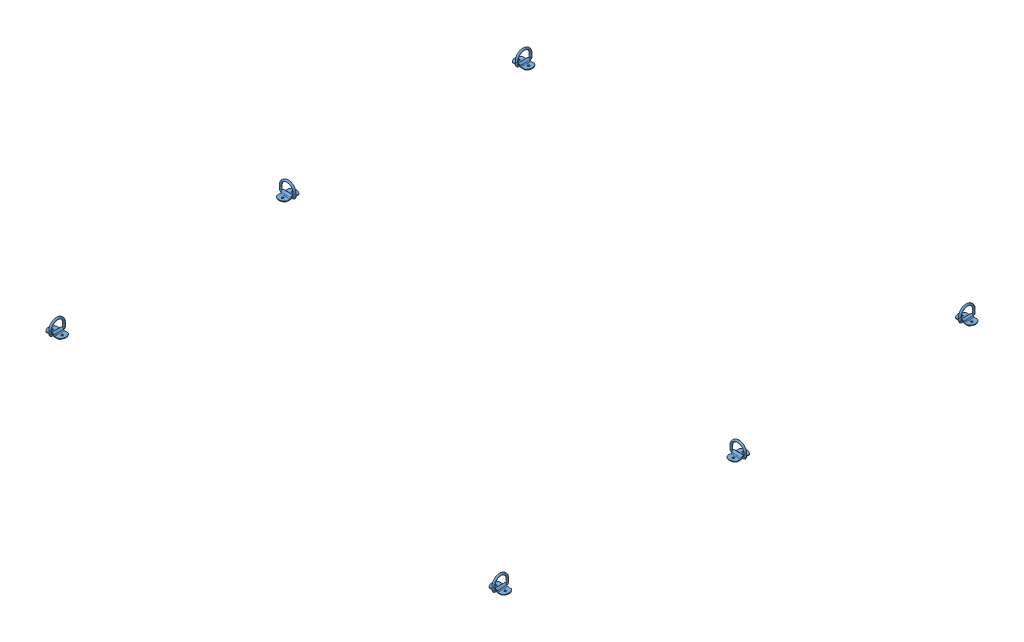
SolidWorks assembly sheet assem v2.SLDASM, configuration Default (file format 10000). Lengths in mm.
Overall size (1574.8 61.98 2235.2).
8 component instances, 3 part files, 21 mates.
Components (placement in the parent):
- Part H-1: Part H.SLDPRT [Default] at (1163.067 801.1916 852.2516) size (1574.8 19.05 1219.2)
- Part I-2: Part I.SLDPRT [cut] at (1163.067 801.1916 2071.4516) size (1574.8 19.05 1016)
- 3076T340_TIE-DOWN RING-19: 3076T340_TIE-DOWN RING.SLDPRT [Default] at (22.4482 823.4801 718.9016) x (0 0 1) z (-1 0 0) size (50.8 42.93 55.56)
- 3076T340_TIE-DOWN RING-20: 3076T340_TIE-DOWN RING.SLDPRT [Default] at (1440.0857 823.4801 718.9016) x (0 0 1) z (-1 0 0) size (50.8 42.93 55.56)
- 3076T340_TIE-DOWN RING-21: 3076T340_TIE-DOWN RING.SLDPRT [Default] at (10.542 823.4801 1461.917) size (50.8 42.93 55.56)
- 3076T340_TIE-DOWN RING-22: 3076T340_TIE-DOWN RING.SLDPRT [Default] at (1451.992 823.4801 1461.917) size (50.8 42.93 55.56)
- 3076T340_TIE-DOWN RING-23: 3076T340_TIE-DOWN RING.SLDPRT [Default] at (22.4482 823.4801 2211.1516) x (0 0 1) z (-1 0 0) size (50.8 42.93 55.56)
- 3076T340_TIE-DOWN RING-24: 3076T340_TIE-DOWN RING.SLDPRT [Default] at (1440.1215 823.4801 2211.1516) x (0 0 -1) z (1 0 0) size (50.8 42.93 55.56)
Mates (geometry in assembly coordinates):
- Coincident1: coincident aligned: plane of Part H-1 through (1163.067 820.2416 852.2516) normal (0 1 0); plane of Part I-2 through (1163.067 820.2416 2071.4516) normal (0 1 0)
- Coincident4: coincident anti-aligned: plane of Part I-2 through (1163.067 820.2416 2071.4516) normal (0 1 0); plane of 3076T340_TIE-DOWN RING-23 through (-5.333 820.2416 2227.0266) normal (0 -1 0)
- Coincident5: coincident anti-aligned: plane of Part I-2 through (1163.067 820.2416 2071.4516) normal (0 1 0); plane of 3076T340_TIE-DOWN RING-24 through (1467.9027 820.2416 2195.2766) normal (0 -1 0)
- Coincident6: coincident anti-aligned: plane of Part I-2 through (1163.067 820.2416 2071.4516) normal (0 1 0); plane of 3076T340_TIE-DOWN RING-22 through (1467.867 820.2416 1489.6983) normal (0 -1 0)
- Coincident7: coincident anti-aligned: plane of Part I-2 through (1163.067 820.2416 2071.4516) normal (0 1 0); plane of 3076T340_TIE-DOWN RING-21 through (26.417 820.2416 1489.6983) normal (0 -1 0)
- Coincident8: coincident anti-aligned: plane of Part I-2 through (1163.067 820.2416 2071.4516) normal (0 1 0); plane of 3076T340_TIE-DOWN RING-20 through (1412.3045 820.2416 734.7766) normal (0 -1 0)
- Coincident9: coincident anti-aligned: plane of Part I-2 through (1163.067 820.2416 2071.4516) normal (0 1 0); plane of 3076T340_TIE-DOWN RING-19 through (50.2295 820.2416 734.7766) normal (0 -1 0)
- Distance1: distance = 50.8 mm aligned: plane of 3076T340_TIE-DOWN RING-21 through (-5.333 825.0041 1469.7715) normal (-1 0 0); plane of Part H-1 through (-56.133 820.2416 242.6516) normal (-1 0 0)
- Distance3: distance = 460.375 mm aligned: plane of Part H-1 through (-56.133 820.2416 242.6516) normal (0 0 -1); plane of 3076T340_TIE-DOWN RING-20 through (1432.2312 825.0041 703.0266) normal (0 0 -1)
- Distance4: distance = 460.375 mm aligned: plane of Part H-1 through (-56.133 820.2416 242.6516) normal (0 0 -1); plane of 3076T340_TIE-DOWN RING-19 through (14.5937 825.0041 703.0266) normal (0 0 -1)
- Distance5: distance = 250.825 mm aligned: plane of Part I-2 through (-56.133 801.1916 2477.8516) normal (0 0 1); plane of 3076T340_TIE-DOWN RING-23 through (14.5937 825.0041 2227.0266) normal (0 0 1)
- Distance6: distance = 250.825 mm aligned: plane of 3076T340_TIE-DOWN RING-24 through (1447.976 825.0041 2227.0266) normal (0 0 1); plane of Part I-2 through (-56.133 801.1916 2477.8516) normal (0 0 1)
- Distance8: distance = 50.8 mm: moEndPointRef_w of 3076T340_TIE-DOWN RING-20; plane of Part H-1 through (1518.667 801.1916 242.6516) normal (1 0 0)
- Distance9: distance = 50.8 mm: moEndPointRef_w of 3076T340_TIE-DOWN RING-19; plane of Part H-1 through (-56.133 820.2416 242.6516) normal (-1 0 0)
- Distance10: distance = 50.8 mm: moEndPointRef_w of 3076T340_TIE-DOWN RING-23; plane of Part I-2 through (-56.133 820.2416 1461.8516) normal (-1 0 0)
- Distance11: distance = 27.7812 mm: moEndPointRef_w of 3076T340_TIE-DOWN RING-21; line of Part I-2 through (1518.667 820.2416 1461.8516) axis (-1 0 0)
- Distance12: distance = 27.7812 mm: moEndPointRef_w of 3076T340_TIE-DOWN RING-22; line of Part I-2 through (1518.667 820.2416 1461.8516) axis (-1 0 0)
- Coincident10: coincident aligned: plane of Part H-1 through (1518.667 801.1916 242.6516) normal (1 0 0); plane of Part I-2 through (1518.667 801.1916 1461.8516) normal (1 0 0)
- Distance13: distance = 50.8 mm: line of Part I-2 through (1518.667 820.2416 1461.8516) axis (0 0 1); moEndPointRef_w of 3076T340_TIE-DOWN RING-24
- Distance15: distance = 50.8 mm aligned: plane of Part H-1 through (1518.667 801.1916 242.6516) normal (1 0 0); plane of 3076T340_TIE-DOWN RING-22 through (1467.867 825.0041 1469.7715) normal (1 0 0)
- Coincident11: coincident anti-aligned: plane of Part H-1 through (-56.133 820.2416 1461.8516) normal (0 0 1); plane of Part I-2 through (-56.133 820.2416 1461.8516) normal (0 0 -1)
